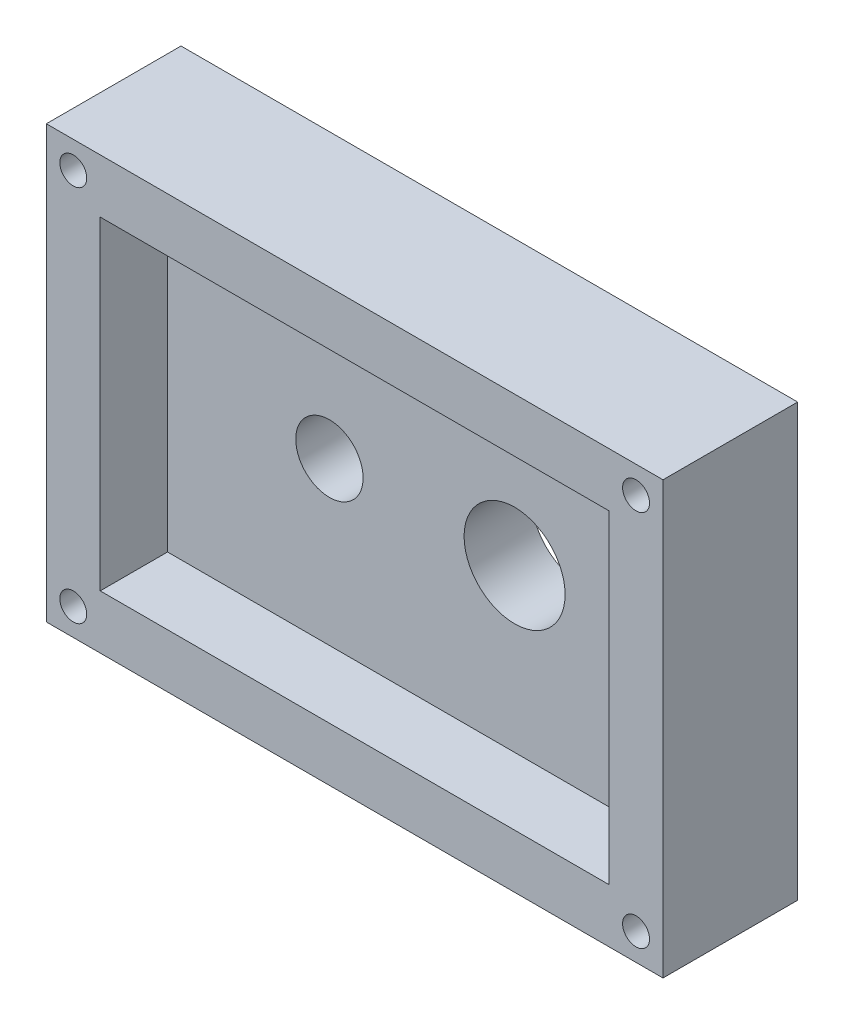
from build123d import *

# Parameters (mm, degrees)
SKETCH1_W           = 58.1533
SKETCH1_H           = 40.6908
BOSS_EXTRUDE1_DEPTH = 12.7
SKETCH2_W           = 47.9933
SKETCH2_H           = 30.5308
CUT_EXTRUDE1_DEPTH  = 6.35
SKETCH3_R           = 3.175
SKETCH3_R_2         = 4.7625
CUT_EXTRUDE2_DEPTH  = 12.7
SKETCH4_R           = 1.27
CUT_EXTRUDE3_DEPTH  = 12.7


with BuildPart() as part:
    # Sketch1 → Boss-Extrude1 (new body)
    with BuildSketch(Plane.XY):
        Rectangle(SKETCH1_W, SKETCH1_H)
    extrude(amount=-BOSS_EXTRUDE1_DEPTH)

    # Sketch2 → Cut-Extrude1 (cut)
    with BuildSketch(Plane.XY):
        Rectangle(SKETCH2_W, SKETCH2_H)
    extrude(amount=-CUT_EXTRUDE1_DEPTH, mode=Mode.SUBTRACT)

    # Sketch3 → Cut-Extrude2 (cut)
    with BuildSketch(Plane.XY):
        with Locations((-8.73125, 0)):
            Circle(SKETCH3_R)
        with Locations((8.73125, 0)):
            Circle(SKETCH3_R_2)
    extrude(amount=-CUT_EXTRUDE2_DEPTH, mode=Mode.SUBTRACT)

    # Sketch4 → Cut-Extrude3 (cut)
    with BuildSketch(Plane.XY):
        with Locations((26.53665, 17.8054)):
            Circle(SKETCH4_R)
        with Locations((-26.53665, 17.8054)):
            Circle(SKETCH4_R)
        with Locations((26.53665, -17.8054)):
            Circle(SKETCH4_R)
        with Locations((-26.53665, -17.8054)):
            Circle(SKETCH4_R)
    extrude(amount=-CUT_EXTRUDE3_DEPTH, mode=Mode.SUBTRACT)


solid = part.part
